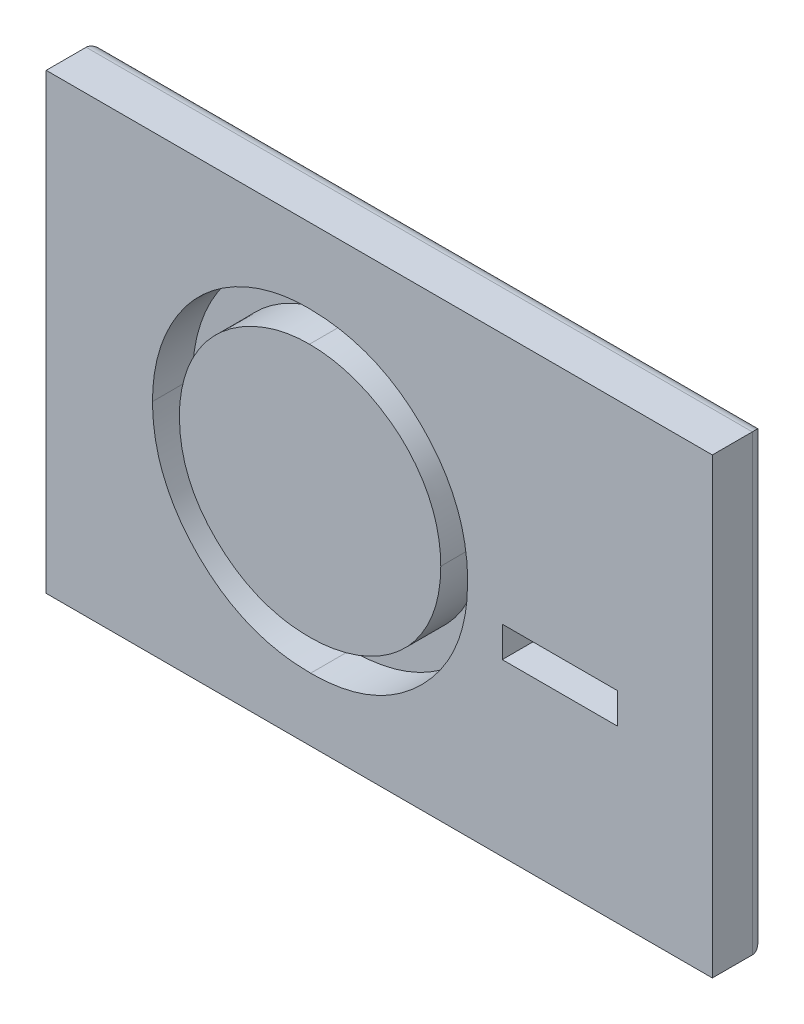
from build123d import *

# Parameters (mm, degrees)
SKETCH1_W           = 31.75
SKETCH1_H           = 21.59
BOSS_EXTRUDE1_DEPTH = 2.54
FILLET1_R           = 0.635
SKETCH2_W           = 5.495192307
SKETCH2_H           = 1.465384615
CUT_EXTRUDE1_DEPTH  = 1.905


with BuildPart() as part:
    # Sketch1 → Boss-Extrude1 (new body)
    with BuildSketch(Plane.XY):
        Rectangle(SKETCH1_W, SKETCH1_H)
    extrude(amount=BOSS_EXTRUDE1_DEPTH)

    # Fillet1
    fillet1_edges = [part.edges().sort_by_distance(p)[0] for p in [
        (0, -10.795, 0),
        (-15.875, 0, 0),
        (0, 10.795, 0),
        (15.875, 0, 0),
    ]]
    fillet(fillet1_edges, radius=FILLET1_R)

    # Sketch2 → Cut-Extrude1 (cut)
    # profile 1 of 2: a face of its own
    with BuildSketch(Plane.XY.offset(2.54)):
        with BuildLine():
            add(Edge.make_bspline(
                [(-3.388701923, 7.231115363), (-3.124145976, 7.22441461), (-2.60453627, 7.211253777), (-1.840869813, 7.110510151), (-1.11181912, 6.93622147), (-0.411445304, 6.704098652), (0.25187424, 6.394450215), (0.88313229, 6.020178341), (1.480826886, 5.57736194), (2.036902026, 5.06942406), (2.545769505, 4.516769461), (2.994094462, 3.926989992), (3.369824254, 3.303651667), (3.678376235, 2.648627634), (3.920441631, 1.963399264), (4.087479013, 1.24431346), (4.194178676, 0.496029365), (4.206652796, -0.014348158), (4.212980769, -0.273256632)],
                knots=[0, 0, 0, 0, 1.065120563, 2.091984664, 3.0946048, 4.079830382, 5.057816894, 6.036188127, 7.030412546, 8.04752943, 9.064399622, 10.05169764, 11.02544977, 11.989514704, 12.962713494, 13.945757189, 14.957906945, 16, 16, 16, 16], degree=3))
            add(Edge.make_bspline(
                [(4.212980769, -0.273256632), (4.206653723, -0.530257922), (4.194182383, -1.036837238), (4.087357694, -1.780372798), (3.919822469, -2.495118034), (3.68062414, -3.179879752), (3.37354299, -3.835380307), (2.995311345, -4.459894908), (2.549781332, -5.053628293), (2.042751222, -5.610076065), (1.490024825, -6.120333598), (0.897174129, -6.564956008), (0.277532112, -6.947551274), (-0.376875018, -7.252828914), (-1.057368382, -7.496826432), (-1.770038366, -7.66318449), (-2.511545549, -7.770491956), (-3.017204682, -7.782813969), (-3.27421875, -7.789076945)],
                knots=[0, 0, 0, 0, 1.043624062, 2.057103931, 3.04512605, 4.022047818, 4.998200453, 5.980619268, 6.982898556, 8.009068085, 9.034988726, 10.034168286, 11.015286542, 11.987931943, 12.962482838, 13.94673481, 14.956375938, 16, 16, 16, 16], degree=3))
            add(Edge.make_bspline(
                [(-3.27421875, -7.789076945), (-3.533125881, -7.782752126), (-4.043500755, -7.770284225), (-4.792725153, -7.663407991), (-5.512316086, -7.49627974), (-6.200215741, -7.257435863), (-6.856807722, -6.948755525), (-7.483376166, -6.572364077), (-8.077406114, -6.125748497), (-8.6339726, -5.618882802), (-9.143216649, -5.067093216), (-9.587187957, -4.475859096), (-9.963664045, -3.856779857), (-10.271307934, -3.208137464), (-10.514866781, -2.533067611), (-10.681029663, -1.827067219), (-10.788536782, -1.094161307), (-10.800925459, -0.595148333), (-10.807211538, -0.341946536)],
                knots=[0, 0, 0, 0, 1.053102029, 2.075944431, 3.073151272, 4.055350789, 5.033113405, 6.020478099, 7.024410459, 8.052272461, 9.079885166, 10.07527673, 11.055994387, 12.023226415, 12.992069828, 13.970394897, 14.97016774, 16, 16, 16, 16], degree=3))
            add(Edge.make_bspline(
                [(-10.807211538, -0.341946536), (-10.80502908, -0.171996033), (-10.800691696, 0.165760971), (-10.74847418, 0.667319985), (-10.672702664, 1.16081292), (-10.564109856, 1.644836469), (-10.422085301, 2.118205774), (-10.254505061, 2.584185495), (-10.049827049, 3.038053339), (-9.818448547, 3.481959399), (-9.560204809, 3.908983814), (-9.274962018, 4.312624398), (-8.972739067, 4.696268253), (-8.6414185, 5.049973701), (-8.291919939, 5.384030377), (-7.918573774, 5.693304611), (-7.523658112, 5.980585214), (-7.105473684, 6.239476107), (-6.674324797, 6.473624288), (-6.229874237, 6.674554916), (-5.778158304, 6.847009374), (-5.317061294, 6.986785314), (-4.847807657, 7.097133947), (-4.369373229, 7.172275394), (-3.882139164, 7.224626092), (-3.553888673, 7.228942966), (-3.388701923, 7.231115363)],
                knots=[0, 0, 0, 0, 1.037015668, 2.060948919, 3.074880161, 4.083647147, 5.086022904, 6.090072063, 7.104153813, 8.122640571, 9.144368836, 10.147691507, 11.138137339, 12.123020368, 13.103399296, 14.087645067, 15.080126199, 16.082011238, 17.087798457, 18.072939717, 19.057185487, 20.037253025, 21.01195951, 21.997135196, 22.992090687, 24, 24, 24, 24], degree=3))
        make_face()
        with BuildLine():
            add(Edge.make_bspline(
                [(-3.325736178, 5.765730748), (-3.461323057, 5.764077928), (-3.731200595, 5.760788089), (-4.132412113, 5.717453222), (-4.528347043, 5.655690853), (-4.919087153, 5.567592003), (-5.302997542, 5.447560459), (-5.683656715, 5.309417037), (-6.057593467, 5.141146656), (-6.423573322, 4.951030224), (-6.778373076, 4.740600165), (-7.113160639, 4.508033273), (-7.428802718, 4.258783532), (-7.724526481, 3.992269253), (-7.999463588, 3.7071332), (-8.259025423, 3.407698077), (-8.492808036, 3.085405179), (-8.707061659, 2.748994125), (-8.898791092, 2.398903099), (-9.069283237, 2.03881784), (-9.208745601, 1.665801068), (-9.322483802, 1.283899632), (-9.41678053, 0.893718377), (-9.476518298, 0.492297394), (-9.520329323, 0.081653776), (-9.52343112, -0.195857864), (-9.525, -0.336222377)],
                knots=[0, 0, 0, 0, 1.008559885, 2.007477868, 2.99961109, 3.989939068, 4.984837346, 5.991145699, 7.001802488, 8.033829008, 9.059044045, 10.069351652, 11.065060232, 12.050310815, 13.029377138, 14.011219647, 14.996725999, 15.989392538, 16.977580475, 17.965360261, 18.951710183, 19.937753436, 20.929683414, 21.935841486, 22.955955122, 24, 24, 24, 24], degree=3))
            add(Edge.make_bspline(
                [(-9.525, -0.336222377), (-9.519795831, -0.542624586), (-9.509557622, -0.948681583), (-9.419923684, -1.54372797), (-9.281857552, -2.115588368), (-9.07833266, -2.661133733), (-8.823808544, -3.18505343), (-8.509373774, -3.682699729), (-8.136841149, -4.154207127), (-7.713671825, -4.596283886), (-7.251072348, -4.999786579), (-6.759856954, -5.353967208), (-6.24528812, -5.653638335), (-5.706023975, -5.897771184), (-5.144943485, -6.091222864), (-4.558431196, -6.223805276), (-3.950394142, -6.311062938), (-3.535931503, -6.319442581), (-3.325736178, -6.323692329)],
                knots=[0, 0, 0, 0, 1.032063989, 2.030389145, 3.003944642, 3.970395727, 4.937377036, 5.913328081, 6.909231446, 7.93887556, 8.970685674, 9.976071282, 10.964166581, 11.944589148, 12.933237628, 13.927779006, 14.949070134, 16, 16, 16, 16], degree=3))
            add(Edge.make_bspline(
                [(-3.325736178, -6.323692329), (-3.184455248, -6.321751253), (-2.904252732, -6.317901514), (-2.487484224, -6.279126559), (-2.078224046, -6.216947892), (-1.677046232, -6.127423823), (-1.284406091, -6.015380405), (-0.898664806, -5.882271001), (-0.52393107, -5.716204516), (-0.155477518, -5.532720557), (0.197204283, -5.323550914), (0.533881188, -5.098877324), (0.846067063, -4.849994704), (1.141569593, -4.587440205), (1.417635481, -4.305919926), (1.67239787, -4.005799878), (1.90499891, -3.685185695), (2.119171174, -3.349284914), (2.310228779, -2.998235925), (2.476694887, -2.636845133), (2.617921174, -2.266002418), (2.73192932, -1.885172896), (2.821268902, -1.49507986), (2.882827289, -1.095200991), (2.925887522, -0.686336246), (2.929133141, -0.409796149), (2.930769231, -0.270394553)],
                knots=[0, 0, 0, 0, 1.047197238, 2.076906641, 3.100256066, 4.114471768, 5.12198147, 6.126382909, 7.136867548, 8.15857795, 9.17633901, 10.174870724, 11.156907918, 12.133735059, 13.104061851, 14.077631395, 15.04955518, 16.038496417, 17.029181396, 18.010275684, 18.986308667, 19.968651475, 20.955262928, 21.950658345, 22.966943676, 24, 24, 24, 24], degree=3))
            add(Edge.make_bspline(
                [(2.930769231, -0.270394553), (2.92913183, -0.131946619), (2.925883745, 0.14269036), (2.882847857, 0.548703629), (2.821203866, 0.945705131), (2.732365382, 1.332136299), (2.617860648, 1.708095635), (2.476670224, 2.073230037), (2.310178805, 2.428899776), (2.119100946, 2.774225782), (1.904315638, 3.105592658), (1.669615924, 3.422376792), (1.41094952, 3.71862909), (1.135706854, 4.001663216), (0.837012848, 4.265442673), (0.516220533, 4.510054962), (0.177224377, 4.741403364), (-0.181707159, 4.950105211), (-0.552136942, 5.142840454), (-0.93224142, 5.307967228), (-1.317714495, 5.448279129), (-1.707575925, 5.567955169), (-2.105107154, 5.655345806), (-2.50762207, 5.717508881), (-2.914563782, 5.760773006), (-3.188243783, 5.764072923), (-3.325736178, 5.765730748)],
                knots=[0, 0, 0, 0, 1.02996197, 2.043119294, 3.035359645, 4.018872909, 4.991431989, 5.957985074, 6.929999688, 7.912076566, 8.892894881, 9.867085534, 10.843653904, 11.817741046, 12.803660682, 13.806313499, 14.818574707, 15.856120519, 16.894564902, 17.924820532, 18.937903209, 19.946497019, 20.957711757, 21.963978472, 22.977135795, 24, 24, 24, 24], degree=3))
        make_face(mode=Mode.SUBTRACT)
    # profile 2 of 2: a face of its own
    with BuildSketch(Plane.XY.offset(2.54)):
        with Locations((8.609134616, -1.927538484)):
            Rectangle(SKETCH2_W, SKETCH2_H)
    extrude(amount=-CUT_EXTRUDE1_DEPTH, mode=Mode.SUBTRACT)


solid = part.part
